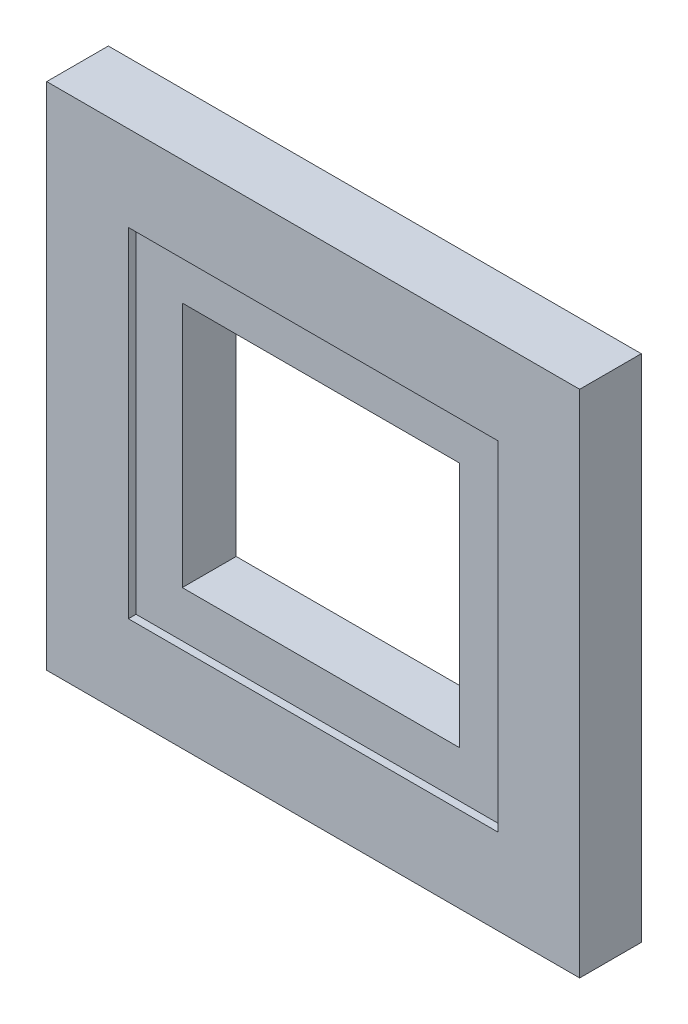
ISO-10303-21;
HEADER;
FILE_DESCRIPTION(('STEP AP214'),'2;1');
FILE_NAME('part.step','',(''),(''),'','','');
FILE_SCHEMA(('AUTOMOTIVE_DESIGN { 1 0 10303 214 1 1 1 1 }'));
ENDSEC;
DATA;
#1=APPLICATION_CONTEXT('core data for automotive mechanical design processes');
#2=APPLICATION_PROTOCOL_DEFINITION('international standard','automotive_design',2000,#1);
#3=PRODUCT_CONTEXT('',#1,'mechanical');
#4=PRODUCT('Part','Part','',(#3));
#5=PRODUCT_RELATED_PRODUCT_CATEGORY('part','',(#4));
#6=PRODUCT_DEFINITION_FORMATION('','',#4);
#7=PRODUCT_DEFINITION_CONTEXT('part definition',#1,'design');
#8=PRODUCT_DEFINITION('design','',#6,#7);
#9=PRODUCT_DEFINITION_SHAPE('','',#8);
#10=(LENGTH_UNIT() NAMED_UNIT(*) SI_UNIT(.MILLI.,.METRE.));
#11=(NAMED_UNIT(*) PLANE_ANGLE_UNIT() SI_UNIT($,.RADIAN.));
#12=(NAMED_UNIT(*) SI_UNIT($,.STERADIAN.) SOLID_ANGLE_UNIT());
#13=UNCERTAINTY_MEASURE_WITH_UNIT(LENGTH_MEASURE(1.E-05),#10,'distance_accuracy_value','');
#14=(GEOMETRIC_REPRESENTATION_CONTEXT(3) GLOBAL_UNCERTAINTY_ASSIGNED_CONTEXT((#13)) GLOBAL_UNIT_ASSIGNED_CONTEXT((#10,
#11,#12)) REPRESENTATION_CONTEXT('',''));
#15=CARTESIAN_POINT('',(0.,0.,0.));
#16=DIRECTION('',(0.,0.,1.));
#17=DIRECTION('',(1.,0.,0.));
#18=AXIS2_PLACEMENT_3D('',#15,#16,#17);
#19=CARTESIAN_POINT('',(0.,0.,25.4));
#20=DIRECTION('',(0.,0.,1.));
#21=DIRECTION('',(1.,0.,0.));
#22=AXIS2_PLACEMENT_3D('',#19,#20,#21);
#23=PLANE('',#22);
#24=DIRECTION('',(0.,-1.,0.));
#25=VECTOR('',#24,1.);
#26=CARTESIAN_POINT('',(-76.2,-69.85,25.4));
#27=LINE('',#26,#25);
#28=CARTESIAN_POINT('',(-76.2,69.85,25.4));
#29=VERTEX_POINT('',#28);
#30=CARTESIAN_POINT('',(-76.2,-69.85,25.4));
#31=VERTEX_POINT('',#30);
#32=EDGE_CURVE('E183',#29,#31,#27,.T.);
#33=ORIENTED_EDGE('',*,*,#32,.F.);
#34=DIRECTION('',(-1.,0.,0.));
#35=VECTOR('',#34,1.);
#36=CARTESIAN_POINT('',(76.2,69.85,25.4));
#37=LINE('',#36,#35);
#38=CARTESIAN_POINT('',(76.2,69.85,25.4));
#39=VERTEX_POINT('',#38);
#40=EDGE_CURVE('E193',#39,#29,#37,.T.);
#41=ORIENTED_EDGE('',*,*,#40,.F.);
#42=DIRECTION('',(0.,1.,0.));
#43=VECTOR('',#42,1.);
#44=CARTESIAN_POINT('',(76.2,-69.85,25.4));
#45=LINE('',#44,#43);
#46=CARTESIAN_POINT('',(76.2,-69.85,25.4));
#47=VERTEX_POINT('',#46);
#48=EDGE_CURVE('E206',#47,#39,#45,.T.);
#49=ORIENTED_EDGE('',*,*,#48,.F.);
#50=DIRECTION('',(1.,0.,0.));
#51=VECTOR('',#50,1.);
#52=CARTESIAN_POINT('',(76.2,-69.85,25.4));
#53=LINE('',#52,#51);
#54=EDGE_CURVE('E203',#31,#47,#53,.T.);
#55=ORIENTED_EDGE('',*,*,#54,.F.);
#56=EDGE_LOOP('',(#33,#41,#49,#55));
#57=FACE_BOUND('',#56,.T.);
#58=DIRECTION('',(0.,1.,0.));
#59=VECTOR('',#58,1.);
#60=CARTESIAN_POINT('',(109.85,-105.0875,25.4));
#61=LINE('',#60,#59);
#62=CARTESIAN_POINT('',(109.85,-105.0875,25.4));
#63=VERTEX_POINT('',#62);
#64=CARTESIAN_POINT('',(109.85,105.0875,25.4));
#65=VERTEX_POINT('',#64);
#66=EDGE_CURVE('E129',#63,#65,#61,.T.);
#67=ORIENTED_EDGE('',*,*,#66,.T.);
#68=DIRECTION('',(-1.,0.,0.));
#69=VECTOR('',#68,1.);
#70=CARTESIAN_POINT('',(109.85,105.0875,25.4));
#71=LINE('',#70,#69);
#72=CARTESIAN_POINT('',(-109.85,105.0875,25.4));
#73=VERTEX_POINT('',#72);
#74=EDGE_CURVE('E138',#65,#73,#71,.T.);
#75=ORIENTED_EDGE('',*,*,#74,.T.);
#76=DIRECTION('',(0.,-1.,0.));
#77=VECTOR('',#76,1.);
#78=CARTESIAN_POINT('',(-109.85,105.0875,25.4));
#79=LINE('',#78,#77);
#80=CARTESIAN_POINT('',(-109.85,-105.0875,25.4));
#81=VERTEX_POINT('',#80);
#82=EDGE_CURVE('E144',#73,#81,#79,.T.);
#83=ORIENTED_EDGE('',*,*,#82,.T.);
#84=DIRECTION('',(1.,0.,0.));
#85=VECTOR('',#84,1.);
#86=CARTESIAN_POINT('',(-109.85,-105.0875,25.4));
#87=LINE('',#86,#85);
#88=EDGE_CURVE('E135',#81,#63,#87,.T.);
#89=ORIENTED_EDGE('',*,*,#88,.T.);
#90=EDGE_LOOP('',(#67,#75,#83,#89));
#91=FACE_BOUND('',#90,.T.);
#92=ADVANCED_FACE('F33',(#57,#91),#23,.T.);
#93=CARTESIAN_POINT('',(0.,0.,0.));
#94=DIRECTION('',(0.,0.,1.));
#95=DIRECTION('',(1.,0.,0.));
#96=AXIS2_PLACEMENT_3D('',#93,#94,#95);
#97=PLANE('',#96);
#98=DIRECTION('',(-1.,0.,0.));
#99=VECTOR('',#98,1.);
#100=CARTESIAN_POINT('',(57.15,50.8,0.));
#101=LINE('',#100,#99);
#102=CARTESIAN_POINT('',(57.15,50.8,0.));
#103=VERTEX_POINT('',#102);
#104=CARTESIAN_POINT('',(-57.15,50.8,0.));
#105=VERTEX_POINT('',#104);
#106=EDGE_CURVE('E167',#103,#105,#101,.T.);
#107=ORIENTED_EDGE('',*,*,#106,.T.);
#108=DIRECTION('',(0.,-1.,0.));
#109=VECTOR('',#108,1.);
#110=CARTESIAN_POINT('',(-57.15,-50.8,0.));
#111=LINE('',#110,#109);
#112=CARTESIAN_POINT('',(-57.15,-50.8,0.));
#113=VERTEX_POINT('',#112);
#114=EDGE_CURVE('E159',#105,#113,#111,.T.);
#115=ORIENTED_EDGE('',*,*,#114,.T.);
#116=DIRECTION('',(1.,0.,0.));
#117=VECTOR('',#116,1.);
#118=CARTESIAN_POINT('',(57.15,-50.8,0.));
#119=LINE('',#118,#117);
#120=CARTESIAN_POINT('',(57.15,-50.8,0.));
#121=VERTEX_POINT('',#120);
#122=EDGE_CURVE('E162',#113,#121,#119,.T.);
#123=ORIENTED_EDGE('',*,*,#122,.T.);
#124=DIRECTION('',(0.,1.,0.));
#125=VECTOR('',#124,1.);
#126=CARTESIAN_POINT('',(57.15,-50.8,0.));
#127=LINE('',#126,#125);
#128=EDGE_CURVE('E50',#121,#103,#127,.T.);
#129=ORIENTED_EDGE('',*,*,#128,.T.);
#130=EDGE_LOOP('',(#107,#115,#123,#129));
#131=FACE_BOUND('',#130,.T.);
#132=DIRECTION('',(0.,-1.,0.));
#133=VECTOR('',#132,1.);
#134=CARTESIAN_POINT('',(109.85,-105.0875,0.));
#135=LINE('',#134,#133);
#136=CARTESIAN_POINT('',(109.85,105.0875,0.));
#137=VERTEX_POINT('',#136);
#138=CARTESIAN_POINT('',(109.85,-105.0875,0.));
#139=VERTEX_POINT('',#138);
#140=EDGE_CURVE('E131',#137,#139,#135,.T.);
#141=ORIENTED_EDGE('',*,*,#140,.T.);
#142=DIRECTION('',(-1.,0.,0.));
#143=VECTOR('',#142,1.);
#144=CARTESIAN_POINT('',(-109.85,-105.0875,0.));
#145=LINE('',#144,#143);
#146=CARTESIAN_POINT('',(-109.85,-105.0875,0.));
#147=VERTEX_POINT('',#146);
#148=EDGE_CURVE('E376',#139,#147,#145,.T.);
#149=ORIENTED_EDGE('',*,*,#148,.T.);
#150=DIRECTION('',(0.,1.,0.));
#151=VECTOR('',#150,1.);
#152=CARTESIAN_POINT('',(-109.85,105.0875,0.));
#153=LINE('',#152,#151);
#154=CARTESIAN_POINT('',(-109.85,105.0875,0.));
#155=VERTEX_POINT('',#154);
#156=EDGE_CURVE('E155',#147,#155,#153,.T.);
#157=ORIENTED_EDGE('',*,*,#156,.T.);
#158=DIRECTION('',(1.,0.,0.));
#159=VECTOR('',#158,1.);
#160=CARTESIAN_POINT('',(109.85,105.0875,0.));
#161=LINE('',#160,#159);
#162=EDGE_CURVE('E173',#155,#137,#161,.T.);
#163=ORIENTED_EDGE('',*,*,#162,.T.);
#164=EDGE_LOOP('',(#141,#149,#157,#163));
#165=FACE_BOUND('',#164,.T.);
#166=ADVANCED_FACE('F35',(#131,#165),#97,.F.);
#167=CARTESIAN_POINT('',(-76.2,-69.85,22.225));
#168=DIRECTION('',(-1.,0.,0.));
#169=DIRECTION('',(0.,0.,1.));
#170=AXIS2_PLACEMENT_3D('',#167,#168,#169);
#171=PLANE('',#170);
#172=ORIENTED_EDGE('',*,*,#32,.T.);
#173=DIRECTION('',(0.,0.,1.));
#174=VECTOR('',#173,1.);
#175=CARTESIAN_POINT('',(-76.2,-69.85,22.225));
#176=LINE('',#175,#174);
#177=CARTESIAN_POINT('',(-76.2,-69.85,22.225));
#178=VERTEX_POINT('',#177);
#179=EDGE_CURVE('E37',#178,#31,#176,.T.);
#180=ORIENTED_EDGE('',*,*,#179,.F.);
#181=DIRECTION('',(0.,-1.,0.));
#182=VECTOR('',#181,1.);
#183=CARTESIAN_POINT('',(-76.2,-69.85,22.225));
#184=LINE('',#183,#182);
#185=CARTESIAN_POINT('',(-76.2,69.85,22.225));
#186=VERTEX_POINT('',#185);
#187=EDGE_CURVE('E189',#186,#178,#184,.T.);
#188=ORIENTED_EDGE('',*,*,#187,.F.);
#189=DIRECTION('',(0.,0.,1.));
#190=VECTOR('',#189,1.);
#191=CARTESIAN_POINT('',(-76.2,69.85,22.225));
#192=LINE('',#191,#190);
#193=EDGE_CURVE('E11',#186,#29,#192,.T.);
#194=ORIENTED_EDGE('',*,*,#193,.T.);
#195=EDGE_LOOP('',(#172,#180,#188,#194));
#196=FACE_BOUND('',#195,.T.);
#197=ADVANCED_FACE('F231',(#196),#171,.F.);
#198=CARTESIAN_POINT('',(76.2,69.85,22.225));
#199=DIRECTION('',(0.,1.,0.));
#200=DIRECTION('',(-1.,0.,0.));
#201=AXIS2_PLACEMENT_3D('',#198,#199,#200);
#202=PLANE('',#201);
#203=ORIENTED_EDGE('',*,*,#40,.T.);
#204=ORIENTED_EDGE('',*,*,#193,.F.);
#205=DIRECTION('',(-1.,0.,0.));
#206=VECTOR('',#205,1.);
#207=CARTESIAN_POINT('',(76.2,69.85,22.225));
#208=LINE('',#207,#206);
#209=CARTESIAN_POINT('',(76.2,69.85,22.225));
#210=VERTEX_POINT('',#209);
#211=EDGE_CURVE('E199',#210,#186,#208,.T.);
#212=ORIENTED_EDGE('',*,*,#211,.F.);
#213=DIRECTION('',(0.,0.,1.));
#214=VECTOR('',#213,1.);
#215=CARTESIAN_POINT('',(76.2,69.85,22.225));
#216=LINE('',#215,#214);
#217=EDGE_CURVE('E42',#210,#39,#216,.T.);
#218=ORIENTED_EDGE('',*,*,#217,.T.);
#219=EDGE_LOOP('',(#203,#204,#212,#218));
#220=FACE_BOUND('',#219,.T.);
#221=ADVANCED_FACE('F230',(#220),#202,.F.);
#222=CARTESIAN_POINT('',(76.2,-69.85,22.225));
#223=DIRECTION('',(1.,0.,0.));
#224=DIRECTION('',(0.,0.,-1.));
#225=AXIS2_PLACEMENT_3D('',#222,#223,#224);
#226=PLANE('',#225);
#227=ORIENTED_EDGE('',*,*,#48,.T.);
#228=ORIENTED_EDGE('',*,*,#217,.F.);
#229=DIRECTION('',(0.,1.,0.));
#230=VECTOR('',#229,1.);
#231=CARTESIAN_POINT('',(76.2,-69.85,22.225));
#232=LINE('',#231,#230);
#233=CARTESIAN_POINT('',(76.2,-69.85,22.225));
#234=VERTEX_POINT('',#233);
#235=EDGE_CURVE('E196',#234,#210,#232,.T.);
#236=ORIENTED_EDGE('',*,*,#235,.F.);
#237=DIRECTION('',(0.,0.,1.));
#238=VECTOR('',#237,1.);
#239=CARTESIAN_POINT('',(76.2,-69.85,22.225));
#240=LINE('',#239,#238);
#241=EDGE_CURVE('E211',#234,#47,#240,.T.);
#242=ORIENTED_EDGE('',*,*,#241,.T.);
#243=EDGE_LOOP('',(#227,#228,#236,#242));
#244=FACE_BOUND('',#243,.T.);
#245=ADVANCED_FACE('F225',(#244),#226,.F.);
#246=CARTESIAN_POINT('',(76.2,-69.85,22.225));
#247=DIRECTION('',(0.,-1.,0.));
#248=DIRECTION('',(0.,0.,-1.));
#249=AXIS2_PLACEMENT_3D('',#246,#247,#248);
#250=PLANE('',#249);
#251=ORIENTED_EDGE('',*,*,#54,.T.);
#252=ORIENTED_EDGE('',*,*,#241,.F.);
#253=DIRECTION('',(1.,0.,0.));
#254=VECTOR('',#253,1.);
#255=CARTESIAN_POINT('',(76.2,-69.85,22.225));
#256=LINE('',#255,#254);
#257=EDGE_CURVE('E192',#178,#234,#256,.T.);
#258=ORIENTED_EDGE('',*,*,#257,.F.);
#259=ORIENTED_EDGE('',*,*,#179,.T.);
#260=EDGE_LOOP('',(#251,#252,#258,#259));
#261=FACE_BOUND('',#260,.T.);
#262=ADVANCED_FACE('F218',(#261),#250,.F.);
#263=CARTESIAN_POINT('',(0.,0.,22.225));
#264=DIRECTION('',(0.,0.,1.));
#265=DIRECTION('',(1.,0.,0.));
#266=AXIS2_PLACEMENT_3D('',#263,#264,#265);
#267=PLANE('',#266);
#268=DIRECTION('',(0.,-1.,0.));
#269=VECTOR('',#268,1.);
#270=CARTESIAN_POINT('',(-57.15,-50.8,22.225));
#271=LINE('',#270,#269);
#272=CARTESIAN_POINT('',(-57.15,50.8,22.225));
#273=VERTEX_POINT('',#272);
#274=CARTESIAN_POINT('',(-57.15,-50.8,22.225));
#275=VERTEX_POINT('',#274);
#276=EDGE_CURVE('E58',#273,#275,#271,.T.);
#277=ORIENTED_EDGE('',*,*,#276,.F.);
#278=DIRECTION('',(-1.,0.,0.));
#279=VECTOR('',#278,1.);
#280=CARTESIAN_POINT('',(57.15,50.8,22.225));
#281=LINE('',#280,#279);
#282=CARTESIAN_POINT('',(57.15,50.8,22.225));
#283=VERTEX_POINT('',#282);
#284=EDGE_CURVE('E163',#283,#273,#281,.T.);
#285=ORIENTED_EDGE('',*,*,#284,.F.);
#286=DIRECTION('',(0.,1.,0.));
#287=VECTOR('',#286,1.);
#288=CARTESIAN_POINT('',(57.15,-50.8,22.225));
#289=LINE('',#288,#287);
#290=CARTESIAN_POINT('',(57.15,-50.8,22.225));
#291=VERTEX_POINT('',#290);
#292=EDGE_CURVE('E176',#291,#283,#289,.T.);
#293=ORIENTED_EDGE('',*,*,#292,.F.);
#294=DIRECTION('',(1.,0.,0.));
#295=VECTOR('',#294,1.);
#296=CARTESIAN_POINT('',(57.15,-50.8,22.225));
#297=LINE('',#296,#295);
#298=EDGE_CURVE('E172',#275,#291,#297,.T.);
#299=ORIENTED_EDGE('',*,*,#298,.F.);
#300=EDGE_LOOP('',(#277,#285,#293,#299));
#301=FACE_BOUND('',#300,.T.);
#302=ORIENTED_EDGE('',*,*,#187,.T.);
#303=ORIENTED_EDGE('',*,*,#257,.T.);
#304=ORIENTED_EDGE('',*,*,#235,.T.);
#305=ORIENTED_EDGE('',*,*,#211,.T.);
#306=EDGE_LOOP('',(#302,#303,#304,#305));
#307=FACE_BOUND('',#306,.T.);
#308=ADVANCED_FACE('F229',(#301,#307),#267,.T.);
#309=CARTESIAN_POINT('',(-57.15,-50.8,0.));
#310=DIRECTION('',(-1.,0.,0.));
#311=DIRECTION('',(0.,0.,1.));
#312=AXIS2_PLACEMENT_3D('',#309,#310,#311);
#313=PLANE('',#312);
#314=ORIENTED_EDGE('',*,*,#276,.T.);
#315=DIRECTION('',(0.,0.,1.));
#316=VECTOR('',#315,1.);
#317=CARTESIAN_POINT('',(-57.15,-50.8,0.));
#318=LINE('',#317,#316);
#319=EDGE_CURVE('E170',#113,#275,#318,.T.);
#320=ORIENTED_EDGE('',*,*,#319,.F.);
#321=ORIENTED_EDGE('',*,*,#114,.F.);
#322=DIRECTION('',(0.,0.,1.));
#323=VECTOR('',#322,1.);
#324=CARTESIAN_POINT('',(-57.15,50.8,0.));
#325=LINE('',#324,#323);
#326=EDGE_CURVE('E181',#105,#273,#325,.T.);
#327=ORIENTED_EDGE('',*,*,#326,.T.);
#328=EDGE_LOOP('',(#314,#320,#321,#327));
#329=FACE_BOUND('',#328,.T.);
#330=ADVANCED_FACE('F297',(#329),#313,.F.);
#331=CARTESIAN_POINT('',(57.15,50.8,0.));
#332=DIRECTION('',(0.,1.,0.));
#333=DIRECTION('',(-1.,0.,0.));
#334=AXIS2_PLACEMENT_3D('',#331,#332,#333);
#335=PLANE('',#334);
#336=ORIENTED_EDGE('',*,*,#284,.T.);
#337=ORIENTED_EDGE('',*,*,#326,.F.);
#338=ORIENTED_EDGE('',*,*,#106,.F.);
#339=DIRECTION('',(0.,0.,1.));
#340=VECTOR('',#339,1.);
#341=CARTESIAN_POINT('',(57.15,50.8,0.));
#342=LINE('',#341,#340);
#343=EDGE_CURVE('E184',#103,#283,#342,.T.);
#344=ORIENTED_EDGE('',*,*,#343,.T.);
#345=EDGE_LOOP('',(#336,#337,#338,#344));
#346=FACE_BOUND('',#345,.T.);
#347=ADVANCED_FACE('F293',(#346),#335,.F.);
#348=CARTESIAN_POINT('',(57.15,-50.8,0.));
#349=DIRECTION('',(1.,0.,0.));
#350=DIRECTION('',(0.,1.,0.));
#351=AXIS2_PLACEMENT_3D('',#348,#349,#350);
#352=PLANE('',#351);
#353=ORIENTED_EDGE('',*,*,#292,.T.);
#354=ORIENTED_EDGE('',*,*,#343,.F.);
#355=ORIENTED_EDGE('',*,*,#128,.F.);
#356=DIRECTION('',(0.,0.,1.));
#357=VECTOR('',#356,1.);
#358=CARTESIAN_POINT('',(57.15,-50.8,0.));
#359=LINE('',#358,#357);
#360=EDGE_CURVE('E186',#121,#291,#359,.T.);
#361=ORIENTED_EDGE('',*,*,#360,.T.);
#362=EDGE_LOOP('',(#353,#354,#355,#361));
#363=FACE_BOUND('',#362,.T.);
#364=ADVANCED_FACE('F296',(#363),#352,.F.);
#365=CARTESIAN_POINT('',(57.15,-50.8,0.));
#366=DIRECTION('',(0.,-1.,0.));
#367=DIRECTION('',(0.,0.,-1.));
#368=AXIS2_PLACEMENT_3D('',#365,#366,#367);
#369=PLANE('',#368);
#370=ORIENTED_EDGE('',*,*,#298,.T.);
#371=ORIENTED_EDGE('',*,*,#360,.F.);
#372=ORIENTED_EDGE('',*,*,#122,.F.);
#373=ORIENTED_EDGE('',*,*,#319,.T.);
#374=EDGE_LOOP('',(#370,#371,#372,#373));
#375=FACE_BOUND('',#374,.T.);
#376=ADVANCED_FACE('F260',(#375),#369,.F.);
#377=CARTESIAN_POINT('',(109.85,105.0875,-304.042136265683));
#378=DIRECTION('',(0.,1.,0.));
#379=DIRECTION('',(0.,0.,1.));
#380=AXIS2_PLACEMENT_3D('',#377,#378,#379);
#381=PLANE('',#380);
#382=ORIENTED_EDGE('',*,*,#162,.F.);
#383=DIRECTION('',(0.,0.,1.));
#384=VECTOR('',#383,1.);
#385=CARTESIAN_POINT('',(-109.85,105.0875,-304.042136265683));
#386=LINE('',#385,#384);
#387=EDGE_CURVE('E134',#155,#73,#386,.T.);
#388=ORIENTED_EDGE('',*,*,#387,.T.);
#389=ORIENTED_EDGE('',*,*,#74,.F.);
#390=DIRECTION('',(0.,0.,1.));
#391=VECTOR('',#390,1.);
#392=CARTESIAN_POINT('',(109.85,105.0875,-304.042136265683));
#393=LINE('',#392,#391);
#394=EDGE_CURVE('E124',#137,#65,#393,.T.);
#395=ORIENTED_EDGE('',*,*,#394,.F.);
#396=EDGE_LOOP('',(#382,#388,#389,#395));
#397=FACE_BOUND('',#396,.T.);
#398=ADVANCED_FACE('F139',(#397),#381,.T.);
#399=CARTESIAN_POINT('',(-109.85,105.0875,-304.042136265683));
#400=DIRECTION('',(-1.,0.,0.));
#401=DIRECTION('',(0.,0.,1.));
#402=AXIS2_PLACEMENT_3D('',#399,#400,#401);
#403=PLANE('',#402);
#404=ORIENTED_EDGE('',*,*,#156,.F.);
#405=DIRECTION('',(0.,0.,1.));
#406=VECTOR('',#405,1.);
#407=CARTESIAN_POINT('',(-109.85,-105.0875,-304.042136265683));
#408=LINE('',#407,#406);
#409=EDGE_CURVE('E156',#147,#81,#408,.T.);
#410=ORIENTED_EDGE('',*,*,#409,.T.);
#411=ORIENTED_EDGE('',*,*,#82,.F.);
#412=ORIENTED_EDGE('',*,*,#387,.F.);
#413=EDGE_LOOP('',(#404,#410,#411,#412));
#414=FACE_BOUND('',#413,.T.);
#415=ADVANCED_FACE('F259',(#414),#403,.T.);
#416=CARTESIAN_POINT('',(-109.85,-105.0875,-304.042136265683));
#417=DIRECTION('',(0.,-1.,0.));
#418=DIRECTION('',(0.,0.,-1.));
#419=AXIS2_PLACEMENT_3D('',#416,#417,#418);
#420=PLANE('',#419);
#421=ORIENTED_EDGE('',*,*,#148,.F.);
#422=DIRECTION('',(0.,0.,1.));
#423=VECTOR('',#422,1.);
#424=CARTESIAN_POINT('',(109.85,-105.0875,-304.042136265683));
#425=LINE('',#424,#423);
#426=EDGE_CURVE('E153',#139,#63,#425,.T.);
#427=ORIENTED_EDGE('',*,*,#426,.T.);
#428=ORIENTED_EDGE('',*,*,#88,.F.);
#429=ORIENTED_EDGE('',*,*,#409,.F.);
#430=EDGE_LOOP('',(#421,#427,#428,#429));
#431=FACE_BOUND('',#430,.T.);
#432=ADVANCED_FACE('F270',(#431),#420,.T.);
#433=CARTESIAN_POINT('',(109.85,-105.0875,-304.042136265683));
#434=DIRECTION('',(1.,0.,0.));
#435=DIRECTION('',(0.,0.,-1.));
#436=AXIS2_PLACEMENT_3D('',#433,#434,#435);
#437=PLANE('',#436);
#438=ORIENTED_EDGE('',*,*,#140,.F.);
#439=ORIENTED_EDGE('',*,*,#394,.T.);
#440=ORIENTED_EDGE('',*,*,#66,.F.);
#441=ORIENTED_EDGE('',*,*,#426,.F.);
#442=EDGE_LOOP('',(#438,#439,#440,#441));
#443=FACE_BOUND('',#442,.T.);
#444=ADVANCED_FACE('F126',(#443),#437,.T.);
#445=CLOSED_SHELL('',(#92,#166,#197,#221,#245,#262,#308,#330,#347,#364,#376,#398,#415,#432,#444));
#446=MANIFOLD_SOLID_BREP('B2',#445);
#447=ADVANCED_BREP_SHAPE_REPRESENTATION('',(#18,#446),#14);
#448=SHAPE_DEFINITION_REPRESENTATION(#9,#447);
ENDSEC;
END-ISO-10303-21;
